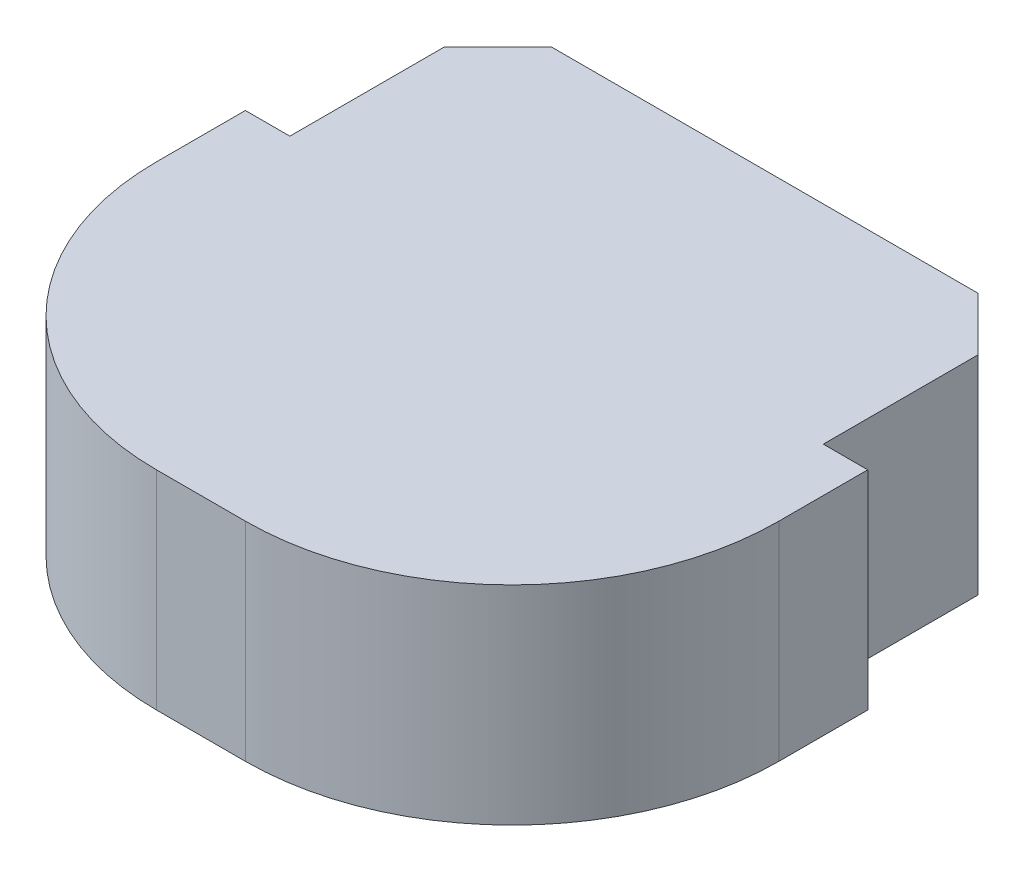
ISO-10303-21;
HEADER;
FILE_DESCRIPTION(('STEP AP214'),'2;1');
FILE_NAME('part.step','',(''),(''),'','','');
FILE_SCHEMA(('AUTOMOTIVE_DESIGN { 1 0 10303 214 1 1 1 1 }'));
ENDSEC;
DATA;
#1=APPLICATION_CONTEXT('core data for automotive mechanical design processes');
#2=APPLICATION_PROTOCOL_DEFINITION('international standard','automotive_design',2000,#1);
#3=PRODUCT_CONTEXT('',#1,'mechanical');
#4=PRODUCT('Part','Part','',(#3));
#5=PRODUCT_RELATED_PRODUCT_CATEGORY('part','',(#4));
#6=PRODUCT_DEFINITION_FORMATION('','',#4);
#7=PRODUCT_DEFINITION_CONTEXT('part definition',#1,'design');
#8=PRODUCT_DEFINITION('design','',#6,#7);
#9=PRODUCT_DEFINITION_SHAPE('','',#8);
#10=(LENGTH_UNIT() NAMED_UNIT(*) SI_UNIT(.MILLI.,.METRE.));
#11=(NAMED_UNIT(*) PLANE_ANGLE_UNIT() SI_UNIT($,.RADIAN.));
#12=(NAMED_UNIT(*) SI_UNIT($,.STERADIAN.) SOLID_ANGLE_UNIT());
#13=UNCERTAINTY_MEASURE_WITH_UNIT(LENGTH_MEASURE(1.E-05),#10,'distance_accuracy_value','');
#14=(GEOMETRIC_REPRESENTATION_CONTEXT(3) GLOBAL_UNCERTAINTY_ASSIGNED_CONTEXT((#13)) GLOBAL_UNIT_ASSIGNED_CONTEXT((#10,
#11,#12)) REPRESENTATION_CONTEXT('',''));
#15=CARTESIAN_POINT('',(0.,0.,0.));
#16=DIRECTION('',(0.,0.,1.));
#17=DIRECTION('',(1.,0.,0.));
#18=AXIS2_PLACEMENT_3D('',#15,#16,#17);
#19=CARTESIAN_POINT('',(-4.445,2.9718,-2.54));
#20=DIRECTION('',(0.,0.,1.));
#21=DIRECTION('',(1.,0.,0.));
#22=AXIS2_PLACEMENT_3D('',#19,#20,#21);
#23=PLANE('',#22);
#24=DIRECTION('',(0.,1.,0.));
#25=VECTOR('',#24,1.);
#26=CARTESIAN_POINT('',(-3.81,2.9718,-2.54));
#27=LINE('',#26,#25);
#28=CARTESIAN_POINT('',(-3.81,0.,-2.54));
#29=VERTEX_POINT('',#28);
#30=CARTESIAN_POINT('',(-3.81,2.9718,-2.54));
#31=VERTEX_POINT('',#30);
#32=EDGE_CURVE('E161',#29,#31,#27,.T.);
#33=ORIENTED_EDGE('',*,*,#32,.F.);
#34=DIRECTION('',(-1.,0.,0.));
#35=VECTOR('',#34,1.);
#36=CARTESIAN_POINT('',(-4.445,0.,-2.54));
#37=LINE('',#36,#35);
#38=CARTESIAN_POINT('',(-4.445,0.,-2.54));
#39=VERTEX_POINT('',#38);
#40=EDGE_CURVE('E156',#29,#39,#37,.T.);
#41=ORIENTED_EDGE('',*,*,#40,.T.);
#42=DIRECTION('',(0.,-1.,0.));
#43=VECTOR('',#42,1.);
#44=CARTESIAN_POINT('',(-4.445,2.9718,-2.54));
#45=LINE('',#44,#43);
#46=CARTESIAN_POINT('',(-4.445,2.9718,-2.54));
#47=VERTEX_POINT('',#46);
#48=EDGE_CURVE('E185',#47,#39,#45,.T.);
#49=ORIENTED_EDGE('',*,*,#48,.F.);
#50=DIRECTION('',(-1.,0.,0.));
#51=VECTOR('',#50,1.);
#52=CARTESIAN_POINT('',(-4.445,2.9718,-2.54));
#53=LINE('',#52,#51);
#54=EDGE_CURVE('E177',#31,#47,#53,.T.);
#55=ORIENTED_EDGE('',*,*,#54,.F.);
#56=EDGE_LOOP('',(#33,#41,#49,#55));
#57=FACE_BOUND('',#56,.T.);
#58=ADVANCED_FACE('F40',(#57),#23,.F.);
#59=DIRECTION('',(0.,-1.,0.));
#60=VECTOR('',#59,1.);
#61=CARTESIAN_POINT('',(3.81,2.9718,-2.54));
#62=LINE('',#61,#60);
#63=CARTESIAN_POINT('',(3.81,2.9718,-2.54));
#64=VERTEX_POINT('',#63);
#65=CARTESIAN_POINT('',(3.81,0.,-2.54));
#66=VERTEX_POINT('',#65);
#67=EDGE_CURVE('E151',#64,#66,#62,.T.);
#68=ORIENTED_EDGE('',*,*,#67,.F.);
#69=CARTESIAN_POINT('',(4.445,2.9718,-2.54));
#70=VERTEX_POINT('',#69);
#71=EDGE_CURVE('E179',#70,#64,#53,.T.);
#72=ORIENTED_EDGE('',*,*,#71,.F.);
#73=DIRECTION('',(0.,-1.,0.));
#74=VECTOR('',#73,1.);
#75=CARTESIAN_POINT('',(4.445,2.9718,-2.54));
#76=LINE('',#75,#74);
#77=CARTESIAN_POINT('',(4.445,0.,-2.54));
#78=VERTEX_POINT('',#77);
#79=EDGE_CURVE('E154',#70,#78,#76,.T.);
#80=ORIENTED_EDGE('',*,*,#79,.T.);
#81=EDGE_CURVE('E137',#78,#66,#37,.T.);
#82=ORIENTED_EDGE('',*,*,#81,.T.);
#83=EDGE_LOOP('',(#68,#72,#80,#82));
#84=FACE_BOUND('',#83,.T.);
#85=ADVANCED_FACE('F149',(#84),#23,.F.);
#86=CARTESIAN_POINT('',(4.445,2.9718,-2.54));
#87=DIRECTION('',(-1.,0.,0.));
#88=DIRECTION('',(0.,0.,1.));
#89=AXIS2_PLACEMENT_3D('',#86,#87,#88);
#90=PLANE('',#89);
#91=DIRECTION('',(0.,0.,-1.));
#92=VECTOR('',#91,1.);
#93=CARTESIAN_POINT('',(4.445,2.9718,-2.54));
#94=LINE('',#93,#92);
#95=CARTESIAN_POINT('',(4.445,2.9718,-1.27));
#96=VERTEX_POINT('',#95);
#97=EDGE_CURVE('E175',#96,#70,#94,.T.);
#98=ORIENTED_EDGE('',*,*,#97,.F.);
#99=DIRECTION('',(0.,-1.,0.));
#100=VECTOR('',#99,1.);
#101=CARTESIAN_POINT('',(4.445,2.9718,-1.27));
#102=LINE('',#101,#100);
#103=CARTESIAN_POINT('',(4.445,0.,-1.27));
#104=VERTEX_POINT('',#103);
#105=EDGE_CURVE('E11',#96,#104,#102,.T.);
#106=ORIENTED_EDGE('',*,*,#105,.T.);
#107=DIRECTION('',(0.,0.,-1.));
#108=VECTOR('',#107,1.);
#109=CARTESIAN_POINT('',(4.445,0.,-2.54));
#110=LINE('',#109,#108);
#111=EDGE_CURVE('E174',#104,#78,#110,.T.);
#112=ORIENTED_EDGE('',*,*,#111,.T.);
#113=ORIENTED_EDGE('',*,*,#79,.F.);
#114=EDGE_LOOP('',(#98,#106,#112,#113));
#115=FACE_BOUND('',#114,.T.);
#116=ADVANCED_FACE('F265',(#115),#90,.F.);
#117=CARTESIAN_POINT('',(-4.445,2.9718,-2.54));
#118=DIRECTION('',(1.,0.,0.));
#119=DIRECTION('',(0.,0.,-1.));
#120=AXIS2_PLACEMENT_3D('',#117,#118,#119);
#121=PLANE('',#120);
#122=DIRECTION('',(0.,0.,1.));
#123=VECTOR('',#122,1.);
#124=CARTESIAN_POINT('',(-4.445,0.,-2.54));
#125=LINE('',#124,#123);
#126=CARTESIAN_POINT('',(-4.445,0.,-1.27));
#127=VERTEX_POINT('',#126);
#128=EDGE_CURVE('E155',#39,#127,#125,.T.);
#129=ORIENTED_EDGE('',*,*,#128,.T.);
#130=DIRECTION('',(0.,-1.,0.));
#131=VECTOR('',#130,1.);
#132=CARTESIAN_POINT('',(-4.445,2.9718,-1.27));
#133=LINE('',#132,#131);
#134=CARTESIAN_POINT('',(-4.445,2.9718,-1.27));
#135=VERTEX_POINT('',#134);
#136=EDGE_CURVE('E63',#127,#135,#133,.F.);
#137=ORIENTED_EDGE('',*,*,#136,.T.);
#138=DIRECTION('',(0.,0.,1.));
#139=VECTOR('',#138,1.);
#140=CARTESIAN_POINT('',(-4.445,2.9718,-2.54));
#141=LINE('',#140,#139);
#142=EDGE_CURVE('E181',#47,#135,#141,.T.);
#143=ORIENTED_EDGE('',*,*,#142,.F.);
#144=ORIENTED_EDGE('',*,*,#48,.T.);
#145=EDGE_LOOP('',(#129,#137,#143,#144));
#146=FACE_BOUND('',#145,.T.);
#147=ADVANCED_FACE('F231',(#146),#121,.F.);
#148=CARTESIAN_POINT('',(-4.445,2.9718,2.54));
#149=DIRECTION('',(0.,0.,-1.));
#150=DIRECTION('',(-1.,0.,0.));
#151=AXIS2_PLACEMENT_3D('',#148,#149,#150);
#152=PLANE('',#151);
#153=DIRECTION('',(1.,0.,0.));
#154=VECTOR('',#153,1.);
#155=CARTESIAN_POINT('',(-4.445,2.9718,2.54));
#156=LINE('',#155,#154);
#157=CARTESIAN_POINT('',(-0.634999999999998,2.9718,2.54));
#158=VERTEX_POINT('',#157);
#159=CARTESIAN_POINT('',(0.635000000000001,2.9718,2.54));
#160=VERTEX_POINT('',#159);
#161=EDGE_CURVE('E183',#158,#160,#156,.T.);
#162=ORIENTED_EDGE('',*,*,#161,.F.);
#163=DIRECTION('',(0.,-1.,0.));
#164=VECTOR('',#163,1.);
#165=CARTESIAN_POINT('',(-0.634999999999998,2.9718,2.54));
#166=LINE('',#165,#164);
#167=CARTESIAN_POINT('',(-0.634999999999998,0.,2.54));
#168=VERTEX_POINT('',#167);
#169=EDGE_CURVE('E212',#158,#168,#166,.T.);
#170=ORIENTED_EDGE('',*,*,#169,.T.);
#171=DIRECTION('',(1.,0.,0.));
#172=VECTOR('',#171,1.);
#173=CARTESIAN_POINT('',(-4.445,0.,2.54));
#174=LINE('',#173,#172);
#175=CARTESIAN_POINT('',(0.635000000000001,0.,2.54));
#176=VERTEX_POINT('',#175);
#177=EDGE_CURVE('E178',#168,#176,#174,.T.);
#178=ORIENTED_EDGE('',*,*,#177,.T.);
#179=DIRECTION('',(0.,-1.,0.));
#180=VECTOR('',#179,1.);
#181=CARTESIAN_POINT('',(0.635000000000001,2.9718,2.54));
#182=LINE('',#181,#180);
#183=EDGE_CURVE('E210',#176,#160,#182,.F.);
#184=ORIENTED_EDGE('',*,*,#183,.T.);
#185=EDGE_LOOP('',(#162,#170,#178,#184));
#186=FACE_BOUND('',#185,.T.);
#187=ADVANCED_FACE('F226',(#186),#152,.F.);
#188=CARTESIAN_POINT('',(0.,2.9718,0.));
#189=DIRECTION('',(0.,1.,0.));
#190=DIRECTION('',(0.,0.,1.));
#191=AXIS2_PLACEMENT_3D('',#188,#189,#190);
#192=PLANE('',#191);
#193=ORIENTED_EDGE('',*,*,#142,.T.);
#194=CARTESIAN_POINT('',(-0.634999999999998,2.9718,-1.27));
#195=DIRECTION('',(0.,1.,0.));
#196=DIRECTION('',(0.,0.,1.));
#197=AXIS2_PLACEMENT_3D('',#194,#195,#196);
#198=CIRCLE('',#197,3.81);
#199=EDGE_CURVE('E48',#135,#158,#198,.T.);
#200=ORIENTED_EDGE('',*,*,#199,.T.);
#201=ORIENTED_EDGE('',*,*,#161,.T.);
#202=CARTESIAN_POINT('',(0.635000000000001,2.9718,-1.27));
#203=DIRECTION('',(0.,1.,0.));
#204=DIRECTION('',(0.,0.,1.));
#205=AXIS2_PLACEMENT_3D('',#202,#203,#204);
#206=CIRCLE('',#205,3.81);
#207=EDGE_CURVE('E55',#160,#96,#206,.T.);
#208=ORIENTED_EDGE('',*,*,#207,.T.);
#209=ORIENTED_EDGE('',*,*,#97,.T.);
#210=ORIENTED_EDGE('',*,*,#71,.T.);
#211=DIRECTION('',(0.,0.,1.));
#212=VECTOR('',#211,1.);
#213=CARTESIAN_POINT('',(3.81,2.9718,-5.5118));
#214=LINE('',#213,#212);
#215=CARTESIAN_POINT('',(3.81,2.9718,-4.7498));
#216=VERTEX_POINT('',#215);
#217=EDGE_CURVE('E144',#216,#64,#214,.T.);
#218=ORIENTED_EDGE('',*,*,#217,.F.);
#219=DIRECTION('',(-0.707106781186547,0.,-0.707106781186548));
#220=VECTOR('',#219,1.);
#221=CARTESIAN_POINT('',(4.2799,2.9718,-4.27989999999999));
#222=LINE('',#221,#220);
#223=CARTESIAN_POINT('',(3.048,2.9718,-5.5118));
#224=VERTEX_POINT('',#223);
#225=EDGE_CURVE('E199',#216,#224,#222,.T.);
#226=ORIENTED_EDGE('',*,*,#225,.T.);
#227=DIRECTION('',(1.,0.,0.));
#228=VECTOR('',#227,1.);
#229=CARTESIAN_POINT('',(3.81,2.9718,-5.5118));
#230=LINE('',#229,#228);
#231=CARTESIAN_POINT('',(-3.048,2.9718,-5.5118));
#232=VERTEX_POINT('',#231);
#233=EDGE_CURVE('E160',#232,#224,#230,.T.);
#234=ORIENTED_EDGE('',*,*,#233,.F.);
#235=DIRECTION('',(-0.707106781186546,0.,0.707106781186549));
#236=VECTOR('',#235,1.);
#237=CARTESIAN_POINT('',(-4.27990000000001,2.9718,-4.27989999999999));
#238=LINE('',#237,#236);
#239=CARTESIAN_POINT('',(-3.81,2.9718,-4.7498));
#240=VERTEX_POINT('',#239);
#241=EDGE_CURVE('E201',#232,#240,#238,.T.);
#242=ORIENTED_EDGE('',*,*,#241,.T.);
#243=DIRECTION('',(0.,0.,1.));
#244=VECTOR('',#243,1.);
#245=CARTESIAN_POINT('',(-3.81,2.9718,-5.5118));
#246=LINE('',#245,#244);
#247=EDGE_CURVE('E172',#240,#31,#246,.T.);
#248=ORIENTED_EDGE('',*,*,#247,.T.);
#249=ORIENTED_EDGE('',*,*,#54,.T.);
#250=EDGE_LOOP('',(#193,#200,#201,#208,#209,#210,#218,#226,#234,#242,#248,#249));
#251=FACE_BOUND('',#250,.T.);
#252=ADVANCED_FACE('F222',(#251),#192,.T.);
#253=CARTESIAN_POINT('',(0.,0.,0.));
#254=DIRECTION('',(0.,1.,0.));
#255=DIRECTION('',(0.,0.,1.));
#256=AXIS2_PLACEMENT_3D('',#253,#254,#255);
#257=PLANE('',#256);
#258=ORIENTED_EDGE('',*,*,#177,.F.);
#259=CARTESIAN_POINT('',(-0.634999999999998,0.,-1.27));
#260=DIRECTION('',(0.,1.,0.));
#261=DIRECTION('',(0.,0.,1.));
#262=AXIS2_PLACEMENT_3D('',#259,#260,#261);
#263=CIRCLE('',#262,3.81);
#264=EDGE_CURVE('E217',#168,#127,#263,.F.);
#265=ORIENTED_EDGE('',*,*,#264,.T.);
#266=ORIENTED_EDGE('',*,*,#128,.F.);
#267=ORIENTED_EDGE('',*,*,#40,.F.);
#268=DIRECTION('',(0.,0.,1.));
#269=VECTOR('',#268,1.);
#270=CARTESIAN_POINT('',(-3.81,0.,-5.5118));
#271=LINE('',#270,#269);
#272=CARTESIAN_POINT('',(-3.81,0.,-4.7498));
#273=VERTEX_POINT('',#272);
#274=EDGE_CURVE('E145',#273,#29,#271,.T.);
#275=ORIENTED_EDGE('',*,*,#274,.F.);
#276=DIRECTION('',(0.707106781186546,0.,-0.707106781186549));
#277=VECTOR('',#276,1.);
#278=CARTESIAN_POINT('',(-3.048,0.,-5.5118));
#279=LINE('',#278,#277);
#280=CARTESIAN_POINT('',(-3.048,0.,-5.5118));
#281=VERTEX_POINT('',#280);
#282=EDGE_CURVE('E206',#273,#281,#279,.T.);
#283=ORIENTED_EDGE('',*,*,#282,.T.);
#284=DIRECTION('',(-1.,0.,0.));
#285=VECTOR('',#284,1.);
#286=CARTESIAN_POINT('',(3.81,0.,-5.5118));
#287=LINE('',#286,#285);
#288=CARTESIAN_POINT('',(3.048,0.,-5.5118));
#289=VERTEX_POINT('',#288);
#290=EDGE_CURVE('E164',#289,#281,#287,.T.);
#291=ORIENTED_EDGE('',*,*,#290,.F.);
#292=DIRECTION('',(0.707106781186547,0.,0.707106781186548));
#293=VECTOR('',#292,1.);
#294=CARTESIAN_POINT('',(3.048,0.,-5.5118));
#295=LINE('',#294,#293);
#296=CARTESIAN_POINT('',(3.81,0.,-4.7498));
#297=VERTEX_POINT('',#296);
#298=EDGE_CURVE('E140',#289,#297,#295,.T.);
#299=ORIENTED_EDGE('',*,*,#298,.T.);
#300=DIRECTION('',(0.,0.,1.));
#301=VECTOR('',#300,1.);
#302=CARTESIAN_POINT('',(3.81,0.,-5.5118));
#303=LINE('',#302,#301);
#304=EDGE_CURVE('E132',#297,#66,#303,.T.);
#305=ORIENTED_EDGE('',*,*,#304,.T.);
#306=ORIENTED_EDGE('',*,*,#81,.F.);
#307=ORIENTED_EDGE('',*,*,#111,.F.);
#308=CARTESIAN_POINT('',(0.635000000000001,0.,-1.27));
#309=DIRECTION('',(0.,1.,0.));
#310=DIRECTION('',(0.,0.,1.));
#311=AXIS2_PLACEMENT_3D('',#308,#309,#310);
#312=CIRCLE('',#311,3.81);
#313=EDGE_CURVE('E215',#104,#176,#312,.F.);
#314=ORIENTED_EDGE('',*,*,#313,.T.);
#315=EDGE_LOOP('',(#258,#265,#266,#267,#275,#283,#291,#299,#305,#306,#307,#314));
#316=FACE_BOUND('',#315,.T.);
#317=ADVANCED_FACE('F135',(#316),#257,.F.);
#318=CARTESIAN_POINT('',(-3.81,2.9718,-5.5118));
#319=DIRECTION('',(1.,0.,0.));
#320=DIRECTION('',(0.,1.,0.));
#321=AXIS2_PLACEMENT_3D('',#318,#319,#320);
#322=PLANE('',#321);
#323=ORIENTED_EDGE('',*,*,#247,.F.);
#324=DIRECTION('',(0.,-1.,0.));
#325=VECTOR('',#324,1.);
#326=CARTESIAN_POINT('',(-3.81,0.,-4.7498));
#327=LINE('',#326,#325);
#328=EDGE_CURVE('E203',#240,#273,#327,.T.);
#329=ORIENTED_EDGE('',*,*,#328,.T.);
#330=ORIENTED_EDGE('',*,*,#274,.T.);
#331=ORIENTED_EDGE('',*,*,#32,.T.);
#332=EDGE_LOOP('',(#323,#329,#330,#331));
#333=FACE_BOUND('',#332,.T.);
#334=ADVANCED_FACE('F298',(#333),#322,.F.);
#335=CARTESIAN_POINT('',(3.81,2.9718,-5.5118));
#336=DIRECTION('',(-1.,0.,0.));
#337=DIRECTION('',(0.,0.,1.));
#338=AXIS2_PLACEMENT_3D('',#335,#336,#337);
#339=PLANE('',#338);
#340=ORIENTED_EDGE('',*,*,#304,.F.);
#341=DIRECTION('',(0.,1.,0.));
#342=VECTOR('',#341,1.);
#343=CARTESIAN_POINT('',(3.81,2.9718,-4.7498));
#344=LINE('',#343,#342);
#345=EDGE_CURVE('E208',#297,#216,#344,.T.);
#346=ORIENTED_EDGE('',*,*,#345,.T.);
#347=ORIENTED_EDGE('',*,*,#217,.T.);
#348=ORIENTED_EDGE('',*,*,#67,.T.);
#349=EDGE_LOOP('',(#340,#346,#347,#348));
#350=FACE_BOUND('',#349,.T.);
#351=ADVANCED_FACE('F158',(#350),#339,.F.);
#352=CARTESIAN_POINT('',(0.,0.,-5.5118));
#353=DIRECTION('',(0.,0.,-1.));
#354=DIRECTION('',(-1.,0.,0.));
#355=AXIS2_PLACEMENT_3D('',#352,#353,#354);
#356=PLANE('',#355);
#357=ORIENTED_EDGE('',*,*,#290,.T.);
#358=DIRECTION('',(0.,1.,0.));
#359=VECTOR('',#358,1.);
#360=CARTESIAN_POINT('',(-3.048,2.9718,-5.5118));
#361=LINE('',#360,#359);
#362=EDGE_CURVE('E196',#281,#232,#361,.T.);
#363=ORIENTED_EDGE('',*,*,#362,.T.);
#364=ORIENTED_EDGE('',*,*,#233,.T.);
#365=DIRECTION('',(0.,-1.,0.));
#366=VECTOR('',#365,1.);
#367=CARTESIAN_POINT('',(3.048,0.,-5.5118));
#368=LINE('',#367,#366);
#369=EDGE_CURVE('E193',#224,#289,#368,.T.);
#370=ORIENTED_EDGE('',*,*,#369,.T.);
#371=EDGE_LOOP('',(#357,#363,#364,#370));
#372=FACE_BOUND('',#371,.T.);
#373=ADVANCED_FACE('F246',(#372),#356,.T.);
#374=CARTESIAN_POINT('',(-3.048,0.,-5.5118));
#375=DIRECTION('',(-0.707106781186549,0.,-0.707106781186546));
#376=DIRECTION('',(0.,-1.,0.));
#377=AXIS2_PLACEMENT_3D('',#374,#375,#376);
#378=PLANE('',#377);
#379=ORIENTED_EDGE('',*,*,#282,.F.);
#380=ORIENTED_EDGE('',*,*,#328,.F.);
#381=ORIENTED_EDGE('',*,*,#241,.F.);
#382=ORIENTED_EDGE('',*,*,#362,.F.);
#383=EDGE_LOOP('',(#379,#380,#381,#382));
#384=FACE_BOUND('',#383,.T.);
#385=ADVANCED_FACE('F243',(#384),#378,.T.);
#386=CARTESIAN_POINT('',(3.048,0.,-5.5118));
#387=DIRECTION('',(0.707106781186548,0.,-0.707106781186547));
#388=DIRECTION('',(0.,1.,0.));
#389=AXIS2_PLACEMENT_3D('',#386,#387,#388);
#390=PLANE('',#389);
#391=ORIENTED_EDGE('',*,*,#225,.F.);
#392=ORIENTED_EDGE('',*,*,#345,.F.);
#393=ORIENTED_EDGE('',*,*,#298,.F.);
#394=ORIENTED_EDGE('',*,*,#369,.F.);
#395=EDGE_LOOP('',(#391,#392,#393,#394));
#396=FACE_BOUND('',#395,.T.);
#397=ADVANCED_FACE('F251',(#396),#390,.T.);
#398=CARTESIAN_POINT('',(-0.634999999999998,2.9718,-1.27));
#399=DIRECTION('',(0.,-1.,0.));
#400=DIRECTION('',(0.,0.,-1.));
#401=AXIS2_PLACEMENT_3D('',#398,#399,#400);
#402=CYLINDRICAL_SURFACE('',#401,3.81);
#403=ORIENTED_EDGE('',*,*,#199,.F.);
#404=ORIENTED_EDGE('',*,*,#136,.F.);
#405=ORIENTED_EDGE('',*,*,#264,.F.);
#406=ORIENTED_EDGE('',*,*,#169,.F.);
#407=EDGE_LOOP('',(#403,#404,#405,#406));
#408=FACE_BOUND('',#407,.T.);
#409=ADVANCED_FACE('F228',(#408),#402,.T.);
#410=CARTESIAN_POINT('',(0.635000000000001,2.9718,-1.27));
#411=DIRECTION('',(0.,-1.,0.));
#412=DIRECTION('',(0.,0.,-1.));
#413=AXIS2_PLACEMENT_3D('',#410,#411,#412);
#414=CYLINDRICAL_SURFACE('',#413,3.81);
#415=ORIENTED_EDGE('',*,*,#207,.F.);
#416=ORIENTED_EDGE('',*,*,#183,.F.);
#417=ORIENTED_EDGE('',*,*,#313,.F.);
#418=ORIENTED_EDGE('',*,*,#105,.F.);
#419=EDGE_LOOP('',(#415,#416,#417,#418));
#420=FACE_BOUND('',#419,.T.);
#421=ADVANCED_FACE('F42',(#420),#414,.T.);
#422=CLOSED_SHELL('',(#58,#85,#116,#147,#187,#252,#317,#334,#351,#373,#385,#397,#409,#421));
#423=MANIFOLD_SOLID_BREP('B2',#422);
#424=ADVANCED_BREP_SHAPE_REPRESENTATION('',(#18,#423),#14);
#425=SHAPE_DEFINITION_REPRESENTATION(#9,#424);
ENDSEC;
END-ISO-10303-21;
